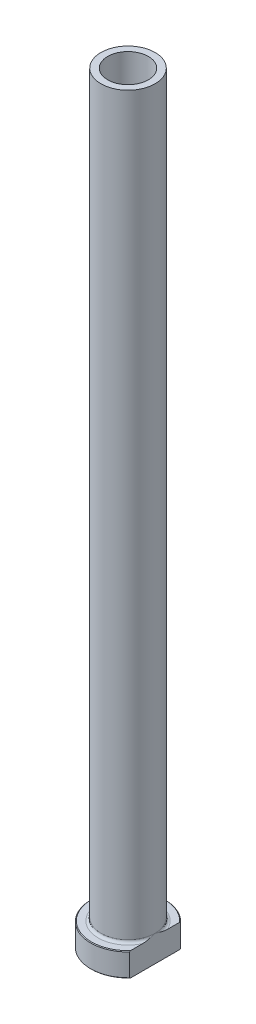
from build123d import *

# Parameters (mm, degrees)
FILLET1_R          = 0.8
CHAMFER1_SIZE      = 0.2
CUT_EXTRUDE1_DEPTH = 226.537136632
CHAMFER2_SIZE      = 0.5


with BuildPart() as part:
    # Sketch1 → Revolve1 (revolve)
    with BuildSketch(Plane.XY, mode=Mode.PRIVATE) as revolve1_sk:
        Polygon((-6, 225), (-8, 225), (-8, 7), (-11, 7), (-11, 0), (-6.25, 0), (-6.25, 158), (-6, 170), align=None)
    revolve(revolve1_sk.sketch.rotate(Axis((0, 92.187680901, 0), (0, -1, 0)), 270), axis=Axis((0, 92.187680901, 0), (0, -1, 0)))

    # Fillet1
    fillet1_edges = [part.edges().sort_by_distance(p)[0] for p in [
        (0, 7, -8),
    ]]
    fillet(fillet1_edges, radius=FILLET1_R)

    # Chamfer1
    chamfer1_edges = [part.edges().sort_by_distance(p)[0] for p in [
        (0, 0, -11),
        (0, 7, -11),
    ]]
    chamfer(chamfer1_edges, length=CHAMFER1_SIZE)

    # Sketch2 → Cut-Extrude1 (cut, through all)
    with BuildSketch(Plane.XZ):
        with BuildLine():
            Line((8, 7.549834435), (8, -7.549834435))
            ThreePointArc((8, -7.549834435), (11, 0), (8, 7.549834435))
        make_face()
    extrude(amount=-CUT_EXTRUDE1_DEPTH, mode=Mode.SUBTRACT)

    # Chamfer2
    chamfer2_edges = [part.edges().sort_by_distance(p)[0] for p in [
        (0, 0, -6.25),
    ]]
    chamfer(chamfer2_edges, length=CHAMFER2_SIZE)


solid = part.part
